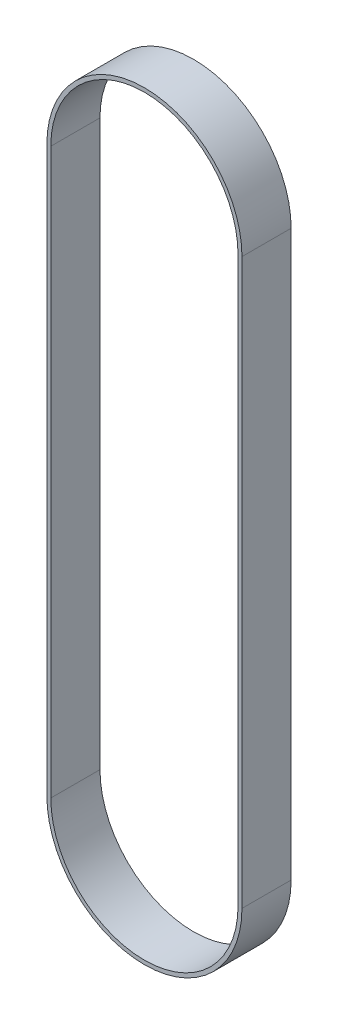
ISO-10303-21;
HEADER;
FILE_DESCRIPTION(('STEP AP214'),'2;1');
FILE_NAME('part.step','',(''),(''),'','','');
FILE_SCHEMA(('AUTOMOTIVE_DESIGN { 1 0 10303 214 1 1 1 1 }'));
ENDSEC;
DATA;
#1=APPLICATION_CONTEXT('core data for automotive mechanical design processes');
#2=APPLICATION_PROTOCOL_DEFINITION('international standard','automotive_design',2000,#1);
#3=PRODUCT_CONTEXT('',#1,'mechanical');
#4=PRODUCT('Part','Part','',(#3));
#5=PRODUCT_RELATED_PRODUCT_CATEGORY('part','',(#4));
#6=PRODUCT_DEFINITION_FORMATION('','',#4);
#7=PRODUCT_DEFINITION_CONTEXT('part definition',#1,'design');
#8=PRODUCT_DEFINITION('design','',#6,#7);
#9=PRODUCT_DEFINITION_SHAPE('','',#8);
#10=(LENGTH_UNIT() NAMED_UNIT(*) SI_UNIT(.MILLI.,.METRE.));
#11=(NAMED_UNIT(*) PLANE_ANGLE_UNIT() SI_UNIT($,.RADIAN.));
#12=(NAMED_UNIT(*) SI_UNIT($,.STERADIAN.) SOLID_ANGLE_UNIT());
#13=UNCERTAINTY_MEASURE_WITH_UNIT(LENGTH_MEASURE(1.E-05),#10,'distance_accuracy_value','');
#14=(GEOMETRIC_REPRESENTATION_CONTEXT(3) GLOBAL_UNCERTAINTY_ASSIGNED_CONTEXT((#13)) GLOBAL_UNIT_ASSIGNED_CONTEXT((#10,
#11,#12)) REPRESENTATION_CONTEXT('',''));
#15=CARTESIAN_POINT('',(0.,0.,0.));
#16=DIRECTION('',(0.,0.,1.));
#17=DIRECTION('',(1.,0.,0.));
#18=AXIS2_PLACEMENT_3D('',#15,#16,#17);
#19=CARTESIAN_POINT('',(0.,0.,31.75));
#20=DIRECTION('',(0.,0.,1.));
#21=DIRECTION('',(1.,0.,0.));
#22=AXIS2_PLACEMENT_3D('',#19,#20,#21);
#23=PLANE('',#22);
#24=CARTESIAN_POINT('',(0.,0.,31.75));
#25=DIRECTION('',(0.,0.,1.));
#26=DIRECTION('',(1.,0.,0.));
#27=AXIS2_PLACEMENT_3D('',#24,#25,#26);
#28=CIRCLE('',#27,62.992);
#29=CARTESIAN_POINT('',(62.992,0.,31.75));
#30=VERTEX_POINT('',#29);
#31=CARTESIAN_POINT('',(-62.992,0.,31.75));
#32=VERTEX_POINT('',#31);
#33=EDGE_CURVE('E141',#30,#32,#28,.T.);
#34=ORIENTED_EDGE('',*,*,#33,.T.);
#35=DIRECTION('',(0.,-1.,0.));
#36=VECTOR('',#35,1.);
#37=CARTESIAN_POINT('',(-62.992,0.,31.75));
#38=LINE('',#37,#36);
#39=CARTESIAN_POINT('',(-62.9919999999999,-364.49,31.75));
#40=VERTEX_POINT('',#39);
#41=EDGE_CURVE('E144',#32,#40,#38,.T.);
#42=ORIENTED_EDGE('',*,*,#41,.T.);
#43=CARTESIAN_POINT('',(0.,-364.49,31.75));
#44=DIRECTION('',(0.,0.,1.));
#45=DIRECTION('',(1.,0.,0.));
#46=AXIS2_PLACEMENT_3D('',#43,#44,#45);
#47=CIRCLE('',#46,62.9919999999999);
#48=CARTESIAN_POINT('',(62.9919999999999,-364.49,31.75));
#49=VERTEX_POINT('',#48);
#50=EDGE_CURVE('E146',#40,#49,#47,.T.);
#51=ORIENTED_EDGE('',*,*,#50,.T.);
#52=DIRECTION('',(0.,1.,0.));
#53=VECTOR('',#52,1.);
#54=CARTESIAN_POINT('',(62.992,0.,31.75));
#55=LINE('',#54,#53);
#56=EDGE_CURVE('E148',#49,#30,#55,.T.);
#57=ORIENTED_EDGE('',*,*,#56,.T.);
#58=EDGE_LOOP('',(#34,#42,#51,#57));
#59=FACE_BOUND('',#58,.T.);
#60=DIRECTION('',(0.,-1.,0.));
#61=VECTOR('',#60,1.);
#62=CARTESIAN_POINT('',(-60.452,0.,31.75));
#63=LINE('',#62,#61);
#64=CARTESIAN_POINT('',(-60.452,0.,31.75));
#65=VERTEX_POINT('',#64);
#66=CARTESIAN_POINT('',(-60.452,-364.49,31.75));
#67=VERTEX_POINT('',#66);
#68=EDGE_CURVE('E123',#65,#67,#63,.T.);
#69=ORIENTED_EDGE('',*,*,#68,.F.);
#70=CARTESIAN_POINT('',(0.,0.,31.75));
#71=DIRECTION('',(0.,0.,1.));
#72=DIRECTION('',(1.,0.,0.));
#73=AXIS2_PLACEMENT_3D('',#70,#71,#72);
#74=CIRCLE('',#73,60.452);
#75=CARTESIAN_POINT('',(60.452,0.,31.75));
#76=VERTEX_POINT('',#75);
#77=EDGE_CURVE('E112',#76,#65,#74,.T.);
#78=ORIENTED_EDGE('',*,*,#77,.F.);
#79=DIRECTION('',(0.,1.,0.));
#80=VECTOR('',#79,1.);
#81=CARTESIAN_POINT('',(60.452,0.,31.75));
#82=LINE('',#81,#80);
#83=CARTESIAN_POINT('',(60.452,-364.49,31.75));
#84=VERTEX_POINT('',#83);
#85=EDGE_CURVE('E127',#84,#76,#82,.T.);
#86=ORIENTED_EDGE('',*,*,#85,.F.);
#87=CARTESIAN_POINT('',(0.,-364.49,31.75));
#88=DIRECTION('',(0.,0.,1.));
#89=DIRECTION('',(1.,0.,0.));
#90=AXIS2_PLACEMENT_3D('',#87,#88,#89);
#91=CIRCLE('',#90,60.452);
#92=EDGE_CURVE('E125',#67,#84,#91,.T.);
#93=ORIENTED_EDGE('',*,*,#92,.F.);
#94=EDGE_LOOP('',(#69,#78,#86,#93));
#95=FACE_BOUND('',#94,.T.);
#96=ADVANCED_FACE('F32',(#59,#95),#23,.T.);
#97=CARTESIAN_POINT('',(0.,0.,0.));
#98=DIRECTION('',(0.,0.,1.));
#99=DIRECTION('',(1.,0.,0.));
#100=AXIS2_PLACEMENT_3D('',#97,#98,#99);
#101=PLANE('',#100);
#102=CARTESIAN_POINT('',(0.,0.,0.));
#103=DIRECTION('',(0.,0.,1.));
#104=DIRECTION('',(1.,0.,0.));
#105=AXIS2_PLACEMENT_3D('',#102,#103,#104);
#106=CIRCLE('',#105,62.992);
#107=CARTESIAN_POINT('',(62.992,0.,0.));
#108=VERTEX_POINT('',#107);
#109=CARTESIAN_POINT('',(-62.992,0.,0.));
#110=VERTEX_POINT('',#109);
#111=EDGE_CURVE('E113',#108,#110,#106,.T.);
#112=ORIENTED_EDGE('',*,*,#111,.F.);
#113=DIRECTION('',(0.,1.,0.));
#114=VECTOR('',#113,1.);
#115=CARTESIAN_POINT('',(62.992,0.,0.));
#116=LINE('',#115,#114);
#117=CARTESIAN_POINT('',(62.9919999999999,-364.49,0.));
#118=VERTEX_POINT('',#117);
#119=EDGE_CURVE('E139',#118,#108,#116,.T.);
#120=ORIENTED_EDGE('',*,*,#119,.F.);
#121=CARTESIAN_POINT('',(0.,-364.49,0.));
#122=DIRECTION('',(0.,0.,1.));
#123=DIRECTION('',(1.,0.,0.));
#124=AXIS2_PLACEMENT_3D('',#121,#122,#123);
#125=CIRCLE('',#124,62.9919999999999);
#126=CARTESIAN_POINT('',(-62.9919999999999,-364.49,0.));
#127=VERTEX_POINT('',#126);
#128=EDGE_CURVE('E137',#127,#118,#125,.T.);
#129=ORIENTED_EDGE('',*,*,#128,.F.);
#130=DIRECTION('',(0.,-1.,0.));
#131=VECTOR('',#130,1.);
#132=CARTESIAN_POINT('',(-62.992,0.,0.));
#133=LINE('',#132,#131);
#134=EDGE_CURVE('E135',#110,#127,#133,.T.);
#135=ORIENTED_EDGE('',*,*,#134,.F.);
#136=EDGE_LOOP('',(#112,#120,#129,#135));
#137=FACE_BOUND('',#136,.T.);
#138=CARTESIAN_POINT('',(0.,0.,0.));
#139=DIRECTION('',(0.,0.,1.));
#140=DIRECTION('',(1.,0.,0.));
#141=AXIS2_PLACEMENT_3D('',#138,#139,#140);
#142=CIRCLE('',#141,60.452);
#143=CARTESIAN_POINT('',(60.452,0.,0.));
#144=VERTEX_POINT('',#143);
#145=CARTESIAN_POINT('',(-60.452,0.,0.));
#146=VERTEX_POINT('',#145);
#147=EDGE_CURVE('E55',#144,#146,#142,.T.);
#148=ORIENTED_EDGE('',*,*,#147,.T.);
#149=DIRECTION('',(0.,-1.,0.));
#150=VECTOR('',#149,1.);
#151=CARTESIAN_POINT('',(-60.452,0.,0.));
#152=LINE('',#151,#150);
#153=CARTESIAN_POINT('',(-60.452,-364.49,0.));
#154=VERTEX_POINT('',#153);
#155=EDGE_CURVE('E99',#146,#154,#152,.T.);
#156=ORIENTED_EDGE('',*,*,#155,.T.);
#157=CARTESIAN_POINT('',(0.,-364.49,0.));
#158=DIRECTION('',(0.,0.,1.));
#159=DIRECTION('',(1.,0.,0.));
#160=AXIS2_PLACEMENT_3D('',#157,#158,#159);
#161=CIRCLE('',#160,60.452);
#162=CARTESIAN_POINT('',(60.452,-364.49,0.));
#163=VERTEX_POINT('',#162);
#164=EDGE_CURVE('E108',#154,#163,#161,.T.);
#165=ORIENTED_EDGE('',*,*,#164,.T.);
#166=DIRECTION('',(0.,1.,0.));
#167=VECTOR('',#166,1.);
#168=CARTESIAN_POINT('',(60.452,0.,0.));
#169=LINE('',#168,#167);
#170=EDGE_CURVE('E117',#163,#144,#169,.T.);
#171=ORIENTED_EDGE('',*,*,#170,.T.);
#172=EDGE_LOOP('',(#148,#156,#165,#171));
#173=FACE_BOUND('',#172,.T.);
#174=ADVANCED_FACE('F116',(#137,#173),#101,.F.);
#175=CARTESIAN_POINT('',(0.,0.,31.75));
#176=DIRECTION('',(0.,0.,-1.));
#177=DIRECTION('',(-1.,0.,0.));
#178=AXIS2_PLACEMENT_3D('',#175,#176,#177);
#179=CYLINDRICAL_SURFACE('',#178,62.992);
#180=ORIENTED_EDGE('',*,*,#111,.T.);
#181=DIRECTION('',(0.,0.,-1.));
#182=VECTOR('',#181,1.);
#183=CARTESIAN_POINT('',(-62.992,0.,31.75));
#184=LINE('',#183,#182);
#185=EDGE_CURVE('E11',#32,#110,#184,.T.);
#186=ORIENTED_EDGE('',*,*,#185,.F.);
#187=ORIENTED_EDGE('',*,*,#33,.F.);
#188=DIRECTION('',(0.,0.,-1.));
#189=VECTOR('',#188,1.);
#190=CARTESIAN_POINT('',(62.992,0.,31.75));
#191=LINE('',#190,#189);
#192=EDGE_CURVE('E150',#30,#108,#191,.T.);
#193=ORIENTED_EDGE('',*,*,#192,.T.);
#194=EDGE_LOOP('',(#180,#186,#187,#193));
#195=FACE_BOUND('',#194,.T.);
#196=ADVANCED_FACE('F34',(#195),#179,.T.);
#197=CARTESIAN_POINT('',(-62.992,0.,31.75));
#198=DIRECTION('',(1.,0.,0.));
#199=DIRECTION('',(0.,1.,0.));
#200=AXIS2_PLACEMENT_3D('',#197,#198,#199);
#201=PLANE('',#200);
#202=ORIENTED_EDGE('',*,*,#134,.T.);
#203=DIRECTION('',(0.,0.,-1.));
#204=VECTOR('',#203,1.);
#205=CARTESIAN_POINT('',(-62.9919999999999,-364.49,31.75));
#206=LINE('',#205,#204);
#207=EDGE_CURVE('E40',#40,#127,#206,.T.);
#208=ORIENTED_EDGE('',*,*,#207,.F.);
#209=ORIENTED_EDGE('',*,*,#41,.F.);
#210=ORIENTED_EDGE('',*,*,#185,.T.);
#211=EDGE_LOOP('',(#202,#208,#209,#210));
#212=FACE_BOUND('',#211,.T.);
#213=ADVANCED_FACE('F175',(#212),#201,.F.);
#214=CARTESIAN_POINT('',(0.,-364.49,31.75));
#215=DIRECTION('',(0.,0.,-1.));
#216=DIRECTION('',(-1.,0.,0.));
#217=AXIS2_PLACEMENT_3D('',#214,#215,#216);
#218=CYLINDRICAL_SURFACE('',#217,62.9919999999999);
#219=ORIENTED_EDGE('',*,*,#128,.T.);
#220=DIRECTION('',(0.,0.,-1.));
#221=VECTOR('',#220,1.);
#222=CARTESIAN_POINT('',(62.9919999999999,-364.49,31.75));
#223=LINE('',#222,#221);
#224=EDGE_CURVE('E153',#49,#118,#223,.T.);
#225=ORIENTED_EDGE('',*,*,#224,.F.);
#226=ORIENTED_EDGE('',*,*,#50,.F.);
#227=ORIENTED_EDGE('',*,*,#207,.T.);
#228=EDGE_LOOP('',(#219,#225,#226,#227));
#229=FACE_BOUND('',#228,.T.);
#230=ADVANCED_FACE('F160',(#229),#218,.T.);
#231=CARTESIAN_POINT('',(62.992,0.,31.75));
#232=DIRECTION('',(-1.,0.,0.));
#233=DIRECTION('',(0.,-1.,0.));
#234=AXIS2_PLACEMENT_3D('',#231,#232,#233);
#235=PLANE('',#234);
#236=ORIENTED_EDGE('',*,*,#119,.T.);
#237=ORIENTED_EDGE('',*,*,#192,.F.);
#238=ORIENTED_EDGE('',*,*,#56,.F.);
#239=ORIENTED_EDGE('',*,*,#224,.T.);
#240=EDGE_LOOP('',(#236,#237,#238,#239));
#241=FACE_BOUND('',#240,.T.);
#242=ADVANCED_FACE('F168',(#241),#235,.F.);
#243=CARTESIAN_POINT('',(0.,0.,31.75));
#244=DIRECTION('',(0.,0.,-1.));
#245=DIRECTION('',(-1.,0.,0.));
#246=AXIS2_PLACEMENT_3D('',#243,#244,#245);
#247=CYLINDRICAL_SURFACE('',#246,60.452);
#248=ORIENTED_EDGE('',*,*,#147,.F.);
#249=DIRECTION('',(0.,0.,-1.));
#250=VECTOR('',#249,1.);
#251=CARTESIAN_POINT('',(60.452,0.,31.75));
#252=LINE('',#251,#250);
#253=EDGE_CURVE('E129',#76,#144,#252,.T.);
#254=ORIENTED_EDGE('',*,*,#253,.F.);
#255=ORIENTED_EDGE('',*,*,#77,.T.);
#256=DIRECTION('',(0.,0.,-1.));
#257=VECTOR('',#256,1.);
#258=CARTESIAN_POINT('',(-60.452,0.,31.75));
#259=LINE('',#258,#257);
#260=EDGE_CURVE('E101',#65,#146,#259,.T.);
#261=ORIENTED_EDGE('',*,*,#260,.T.);
#262=EDGE_LOOP('',(#248,#254,#255,#261));
#263=FACE_BOUND('',#262,.T.);
#264=ADVANCED_FACE('F110',(#263),#247,.F.);
#265=CARTESIAN_POINT('',(-60.452,0.,31.75));
#266=DIRECTION('',(1.,0.,0.));
#267=DIRECTION('',(0.,1.,0.));
#268=AXIS2_PLACEMENT_3D('',#265,#266,#267);
#269=PLANE('',#268);
#270=ORIENTED_EDGE('',*,*,#155,.F.);
#271=ORIENTED_EDGE('',*,*,#260,.F.);
#272=ORIENTED_EDGE('',*,*,#68,.T.);
#273=DIRECTION('',(0.,0.,-1.));
#274=VECTOR('',#273,1.);
#275=CARTESIAN_POINT('',(-60.452,-364.49,31.75));
#276=LINE('',#275,#274);
#277=EDGE_CURVE('E104',#67,#154,#276,.T.);
#278=ORIENTED_EDGE('',*,*,#277,.T.);
#279=EDGE_LOOP('',(#270,#271,#272,#278));
#280=FACE_BOUND('',#279,.T.);
#281=ADVANCED_FACE('F100',(#280),#269,.T.);
#282=CARTESIAN_POINT('',(0.,-364.49,31.75));
#283=DIRECTION('',(0.,0.,-1.));
#284=DIRECTION('',(-1.,0.,0.));
#285=AXIS2_PLACEMENT_3D('',#282,#283,#284);
#286=CYLINDRICAL_SURFACE('',#285,60.452);
#287=ORIENTED_EDGE('',*,*,#164,.F.);
#288=ORIENTED_EDGE('',*,*,#277,.F.);
#289=ORIENTED_EDGE('',*,*,#92,.T.);
#290=DIRECTION('',(0.,0.,-1.));
#291=VECTOR('',#290,1.);
#292=CARTESIAN_POINT('',(60.452,-364.49,31.75));
#293=LINE('',#292,#291);
#294=EDGE_CURVE('E47',#84,#163,#293,.T.);
#295=ORIENTED_EDGE('',*,*,#294,.T.);
#296=EDGE_LOOP('',(#287,#288,#289,#295));
#297=FACE_BOUND('',#296,.T.);
#298=ADVANCED_FACE('F197',(#297),#286,.F.);
#299=CARTESIAN_POINT('',(60.452,0.,31.75));
#300=DIRECTION('',(-1.,0.,0.));
#301=DIRECTION('',(0.,-1.,0.));
#302=AXIS2_PLACEMENT_3D('',#299,#300,#301);
#303=PLANE('',#302);
#304=ORIENTED_EDGE('',*,*,#170,.F.);
#305=ORIENTED_EDGE('',*,*,#294,.F.);
#306=ORIENTED_EDGE('',*,*,#85,.T.);
#307=ORIENTED_EDGE('',*,*,#253,.T.);
#308=EDGE_LOOP('',(#304,#305,#306,#307));
#309=FACE_BOUND('',#308,.T.);
#310=ADVANCED_FACE('F202',(#309),#303,.T.);
#311=CLOSED_SHELL('',(#96,#174,#196,#213,#230,#242,#264,#281,#298,#310));
#312=MANIFOLD_SOLID_BREP('B2',#311);
#313=ADVANCED_BREP_SHAPE_REPRESENTATION('',(#18,#312),#14);
#314=SHAPE_DEFINITION_REPRESENTATION(#9,#313);
ENDSEC;
END-ISO-10303-21;
